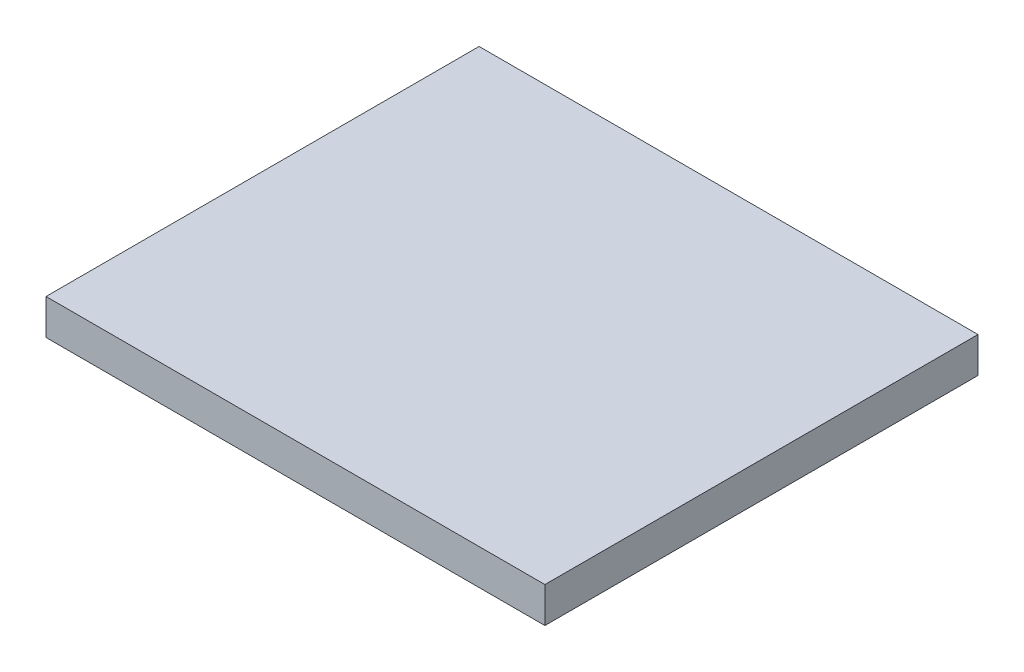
ISO-10303-21;
HEADER;
FILE_DESCRIPTION(('STEP AP214'),'2;1');
FILE_NAME('part.step','',(''),(''),'','','');
FILE_SCHEMA(('AUTOMOTIVE_DESIGN { 1 0 10303 214 1 1 1 1 }'));
ENDSEC;
DATA;
#1=APPLICATION_CONTEXT('core data for automotive mechanical design processes');
#2=APPLICATION_PROTOCOL_DEFINITION('international standard','automotive_design',2000,#1);
#3=PRODUCT_CONTEXT('',#1,'mechanical');
#4=PRODUCT('Part','Part','',(#3));
#5=PRODUCT_RELATED_PRODUCT_CATEGORY('part','',(#4));
#6=PRODUCT_DEFINITION_FORMATION('','',#4);
#7=PRODUCT_DEFINITION_CONTEXT('part definition',#1,'design');
#8=PRODUCT_DEFINITION('design','',#6,#7);
#9=PRODUCT_DEFINITION_SHAPE('','',#8);
#10=(LENGTH_UNIT() NAMED_UNIT(*) SI_UNIT(.MILLI.,.METRE.));
#11=(NAMED_UNIT(*) PLANE_ANGLE_UNIT() SI_UNIT($,.RADIAN.));
#12=(NAMED_UNIT(*) SI_UNIT($,.STERADIAN.) SOLID_ANGLE_UNIT());
#13=UNCERTAINTY_MEASURE_WITH_UNIT(LENGTH_MEASURE(1.E-05),#10,'distance_accuracy_value','');
#14=(GEOMETRIC_REPRESENTATION_CONTEXT(3) GLOBAL_UNCERTAINTY_ASSIGNED_CONTEXT((#13)) GLOBAL_UNIT_ASSIGNED_CONTEXT((#10,
#11,#12)) REPRESENTATION_CONTEXT('',''));
#15=CARTESIAN_POINT('',(0.,0.,0.));
#16=DIRECTION('',(0.,0.,1.));
#17=DIRECTION('',(1.,0.,0.));
#18=AXIS2_PLACEMENT_3D('',#15,#16,#17);
#19=CARTESIAN_POINT('',(28.1447395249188,10.414,30.8828594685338));
#20=DIRECTION('',(-1.,0.,0.));
#21=DIRECTION('',(0.,0.,1.));
#22=AXIS2_PLACEMENT_3D('',#19,#20,#21);
#23=PLANE('',#22);
#24=DIRECTION('',(0.,0.,-1.));
#25=VECTOR('',#24,1.);
#26=CARTESIAN_POINT('',(28.1447395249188,0.,30.8828594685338));
#27=LINE('',#26,#25);
#28=CARTESIAN_POINT('',(28.1447395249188,0.,30.8828594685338));
#29=VERTEX_POINT('',#28);
#30=CARTESIAN_POINT('',(28.1447395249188,0.,-96.1171405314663));
#31=VERTEX_POINT('',#30);
#32=EDGE_CURVE('E93',#29,#31,#27,.T.);
#33=ORIENTED_EDGE('',*,*,#32,.T.);
#34=DIRECTION('',(0.,-1.,0.));
#35=VECTOR('',#34,1.);
#36=CARTESIAN_POINT('',(28.1447395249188,10.414,-96.1171405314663));
#37=LINE('',#36,#35);
#38=CARTESIAN_POINT('',(28.1447395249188,10.414,-96.1171405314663));
#39=VERTEX_POINT('',#38);
#40=EDGE_CURVE('E11',#39,#31,#37,.T.);
#41=ORIENTED_EDGE('',*,*,#40,.F.);
#42=DIRECTION('',(0.,0.,-1.));
#43=VECTOR('',#42,1.);
#44=CARTESIAN_POINT('',(28.1447395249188,10.414,30.8828594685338));
#45=LINE('',#44,#43);
#46=CARTESIAN_POINT('',(28.1447395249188,10.414,30.8828594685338));
#47=VERTEX_POINT('',#46);
#48=EDGE_CURVE('E81',#47,#39,#45,.T.);
#49=ORIENTED_EDGE('',*,*,#48,.F.);
#50=DIRECTION('',(0.,-1.,0.));
#51=VECTOR('',#50,1.);
#52=CARTESIAN_POINT('',(28.1447395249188,10.414,30.8828594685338));
#53=LINE('',#52,#51);
#54=EDGE_CURVE('E89',#47,#29,#53,.T.);
#55=ORIENTED_EDGE('',*,*,#54,.T.);
#56=EDGE_LOOP('',(#33,#41,#49,#55));
#57=FACE_BOUND('',#56,.T.);
#58=ADVANCED_FACE('F30',(#57),#23,.F.);
#59=CARTESIAN_POINT('',(28.1447395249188,10.414,-96.1171405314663));
#60=DIRECTION('',(0.,0.,1.));
#61=DIRECTION('',(1.,0.,0.));
#62=AXIS2_PLACEMENT_3D('',#59,#60,#61);
#63=PLANE('',#62);
#64=DIRECTION('',(-1.,0.,0.));
#65=VECTOR('',#64,1.);
#66=CARTESIAN_POINT('',(28.1447395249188,0.,-96.1171405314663));
#67=LINE('',#66,#65);
#68=CARTESIAN_POINT('',(-118.157371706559,0.,-96.1171405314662));
#69=VERTEX_POINT('',#68);
#70=EDGE_CURVE('E85',#31,#69,#67,.T.);
#71=ORIENTED_EDGE('',*,*,#70,.T.);
#72=DIRECTION('',(0.,-1.,0.));
#73=VECTOR('',#72,1.);
#74=CARTESIAN_POINT('',(-118.157371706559,10.414,-96.1171405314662));
#75=LINE('',#74,#73);
#76=CARTESIAN_POINT('',(-118.157371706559,10.414,-96.1171405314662));
#77=VERTEX_POINT('',#76);
#78=EDGE_CURVE('E38',#77,#69,#75,.T.);
#79=ORIENTED_EDGE('',*,*,#78,.F.);
#80=DIRECTION('',(-1.,0.,0.));
#81=VECTOR('',#80,1.);
#82=CARTESIAN_POINT('',(28.1447395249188,10.414,-96.1171405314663));
#83=LINE('',#82,#81);
#84=EDGE_CURVE('E76',#39,#77,#83,.T.);
#85=ORIENTED_EDGE('',*,*,#84,.F.);
#86=ORIENTED_EDGE('',*,*,#40,.T.);
#87=EDGE_LOOP('',(#71,#79,#85,#86));
#88=FACE_BOUND('',#87,.T.);
#89=ADVANCED_FACE('F84',(#88),#63,.F.);
#90=CARTESIAN_POINT('',(-118.157371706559,10.414,30.8828594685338));
#91=DIRECTION('',(1.,0.,0.));
#92=DIRECTION('',(0.,0.,-1.));
#93=AXIS2_PLACEMENT_3D('',#90,#91,#92);
#94=PLANE('',#93);
#95=DIRECTION('',(0.,0.,1.));
#96=VECTOR('',#95,1.);
#97=CARTESIAN_POINT('',(-118.157371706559,0.,30.8828594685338));
#98=LINE('',#97,#96);
#99=CARTESIAN_POINT('',(-118.157371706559,0.,30.8828594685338));
#100=VERTEX_POINT('',#99);
#101=EDGE_CURVE('E63',#69,#100,#98,.T.);
#102=ORIENTED_EDGE('',*,*,#101,.T.);
#103=DIRECTION('',(0.,-1.,0.));
#104=VECTOR('',#103,1.);
#105=CARTESIAN_POINT('',(-118.157371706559,10.414,30.8828594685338));
#106=LINE('',#105,#104);
#107=CARTESIAN_POINT('',(-118.157371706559,10.414,30.8828594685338));
#108=VERTEX_POINT('',#107);
#109=EDGE_CURVE('E86',#108,#100,#106,.T.);
#110=ORIENTED_EDGE('',*,*,#109,.F.);
#111=DIRECTION('',(0.,0.,1.));
#112=VECTOR('',#111,1.);
#113=CARTESIAN_POINT('',(-118.157371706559,10.414,30.8828594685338));
#114=LINE('',#113,#112);
#115=EDGE_CURVE('E79',#77,#108,#114,.T.);
#116=ORIENTED_EDGE('',*,*,#115,.F.);
#117=ORIENTED_EDGE('',*,*,#78,.T.);
#118=EDGE_LOOP('',(#102,#110,#116,#117));
#119=FACE_BOUND('',#118,.T.);
#120=ADVANCED_FACE('F87',(#119),#94,.F.);
#121=CARTESIAN_POINT('',(28.1447395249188,10.414,30.8828594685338));
#122=DIRECTION('',(0.,0.,-1.));
#123=DIRECTION('',(-1.,0.,0.));
#124=AXIS2_PLACEMENT_3D('',#121,#122,#123);
#125=PLANE('',#124);
#126=DIRECTION('',(1.,0.,0.));
#127=VECTOR('',#126,1.);
#128=CARTESIAN_POINT('',(28.1447395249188,0.,30.8828594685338));
#129=LINE('',#128,#127);
#130=EDGE_CURVE('E69',#100,#29,#129,.T.);
#131=ORIENTED_EDGE('',*,*,#130,.T.);
#132=ORIENTED_EDGE('',*,*,#54,.F.);
#133=DIRECTION('',(1.,0.,0.));
#134=VECTOR('',#133,1.);
#135=CARTESIAN_POINT('',(28.1447395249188,10.414,30.8828594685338));
#136=LINE('',#135,#134);
#137=EDGE_CURVE('E46',#108,#47,#136,.T.);
#138=ORIENTED_EDGE('',*,*,#137,.F.);
#139=ORIENTED_EDGE('',*,*,#109,.T.);
#140=EDGE_LOOP('',(#131,#132,#138,#139));
#141=FACE_BOUND('',#140,.T.);
#142=ADVANCED_FACE('F100',(#141),#125,.F.);
#143=CARTESIAN_POINT('',(28.1447395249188,10.414,-96.1171405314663));
#144=DIRECTION('',(0.,1.,0.));
#145=DIRECTION('',(0.,0.,1.));
#146=AXIS2_PLACEMENT_3D('',#143,#144,#145);
#147=PLANE('',#146);
#148=ORIENTED_EDGE('',*,*,#48,.T.);
#149=ORIENTED_EDGE('',*,*,#84,.T.);
#150=ORIENTED_EDGE('',*,*,#115,.T.);
#151=ORIENTED_EDGE('',*,*,#137,.T.);
#152=EDGE_LOOP('',(#148,#149,#150,#151));
#153=FACE_BOUND('',#152,.T.);
#154=ADVANCED_FACE('F77',(#153),#147,.T.);
#155=CARTESIAN_POINT('',(28.1447395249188,0.,-96.1171405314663));
#156=DIRECTION('',(0.,1.,0.));
#157=DIRECTION('',(0.,0.,1.));
#158=AXIS2_PLACEMENT_3D('',#155,#156,#157);
#159=PLANE('',#158);
#160=ORIENTED_EDGE('',*,*,#32,.F.);
#161=ORIENTED_EDGE('',*,*,#130,.F.);
#162=ORIENTED_EDGE('',*,*,#101,.F.);
#163=ORIENTED_EDGE('',*,*,#70,.F.);
#164=EDGE_LOOP('',(#160,#161,#162,#163));
#165=FACE_BOUND('',#164,.T.);
#166=ADVANCED_FACE('F103',(#165),#159,.F.);
#167=CLOSED_SHELL('',(#58,#89,#120,#142,#154,#166));
#168=MANIFOLD_SOLID_BREP('B2',#167);
#169=ADVANCED_BREP_SHAPE_REPRESENTATION('',(#18,#168),#14);
#170=SHAPE_DEFINITION_REPRESENTATION(#9,#169);
ENDSEC;
END-ISO-10303-21;
